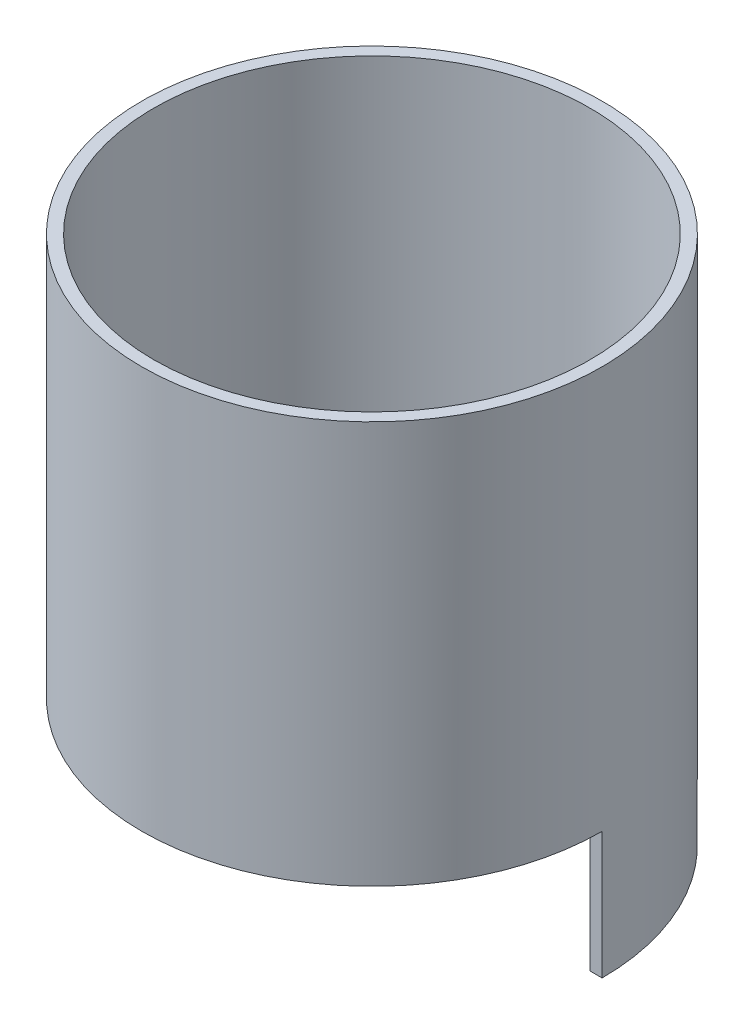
ISO-10303-21;
HEADER;
FILE_DESCRIPTION(('STEP AP214'),'2;1');
FILE_NAME('part.step','',(''),(''),'','','');
FILE_SCHEMA(('AUTOMOTIVE_DESIGN { 1 0 10303 214 1 1 1 1 }'));
ENDSEC;
DATA;
#1=APPLICATION_CONTEXT('core data for automotive mechanical design processes');
#2=APPLICATION_PROTOCOL_DEFINITION('international standard','automotive_design',2000,#1);
#3=PRODUCT_CONTEXT('',#1,'mechanical');
#4=PRODUCT('Part','Part','',(#3));
#5=PRODUCT_RELATED_PRODUCT_CATEGORY('part','',(#4));
#6=PRODUCT_DEFINITION_FORMATION('','',#4);
#7=PRODUCT_DEFINITION_CONTEXT('part definition',#1,'design');
#8=PRODUCT_DEFINITION('design','',#6,#7);
#9=PRODUCT_DEFINITION_SHAPE('','',#8);
#10=(LENGTH_UNIT() NAMED_UNIT(*) SI_UNIT(.MILLI.,.METRE.));
#11=(NAMED_UNIT(*) PLANE_ANGLE_UNIT() SI_UNIT($,.RADIAN.));
#12=(NAMED_UNIT(*) SI_UNIT($,.STERADIAN.) SOLID_ANGLE_UNIT());
#13=UNCERTAINTY_MEASURE_WITH_UNIT(LENGTH_MEASURE(1.E-05),#10,'distance_accuracy_value','');
#14=(GEOMETRIC_REPRESENTATION_CONTEXT(3) GLOBAL_UNCERTAINTY_ASSIGNED_CONTEXT((#13)) GLOBAL_UNIT_ASSIGNED_CONTEXT((#10,
#11,#12)) REPRESENTATION_CONTEXT('',''));
#15=CARTESIAN_POINT('',(0.,0.,0.));
#16=DIRECTION('',(0.,0.,1.));
#17=DIRECTION('',(1.,0.,0.));
#18=AXIS2_PLACEMENT_3D('',#15,#16,#17);
#19=CARTESIAN_POINT('',(0.,0.,0.));
#20=DIRECTION('',(0.,1.,0.));
#21=DIRECTION('',(0.,0.,1.));
#22=AXIS2_PLACEMENT_3D('',#19,#20,#21);
#23=CYLINDRICAL_SURFACE('',#22,36.05);
#24=CARTESIAN_POINT('',(0.,87.5,0.));
#25=DIRECTION('',(0.,1.,0.));
#26=DIRECTION('',(0.,0.,1.));
#27=AXIS2_PLACEMENT_3D('',#24,#25,#26);
#28=CIRCLE('',#27,36.05);
#29=CARTESIAN_POINT('',(0.,87.5,36.05));
#30=VERTEX_POINT('',#29);
#31=EDGE_CURVE('E87',#30,#30,#28,.F.);
#32=ORIENTED_EDGE('',*,*,#31,.F.);
#33=EDGE_LOOP('',(#32));
#34=FACE_BOUND('',#33,.T.);
#35=DIRECTION('',(0.,1.,0.));
#36=VECTOR('',#35,1.);
#37=CARTESIAN_POINT('',(36.05,0.,0.));
#38=LINE('',#37,#36);
#39=CARTESIAN_POINT('',(36.05,0.,0.));
#40=VERTEX_POINT('',#39);
#41=CARTESIAN_POINT('',(36.05,21.,0.));
#42=VERTEX_POINT('',#41);
#43=EDGE_CURVE('E51',#40,#42,#38,.T.);
#44=ORIENTED_EDGE('',*,*,#43,.T.);
#45=CARTESIAN_POINT('',(0.,21.,0.));
#46=DIRECTION('',(0.,1.,0.));
#47=DIRECTION('',(0.,0.,1.));
#48=AXIS2_PLACEMENT_3D('',#45,#46,#47);
#49=CIRCLE('',#48,36.05);
#50=CARTESIAN_POINT('',(-36.05,21.,0.));
#51=VERTEX_POINT('',#50);
#52=EDGE_CURVE('E19',#42,#51,#49,.F.);
#53=ORIENTED_EDGE('',*,*,#52,.T.);
#54=DIRECTION('',(0.,1.,0.));
#55=VECTOR('',#54,1.);
#56=CARTESIAN_POINT('',(-36.05,0.,0.));
#57=LINE('',#56,#55);
#58=CARTESIAN_POINT('',(-36.05,0.,0.));
#59=VERTEX_POINT('',#58);
#60=EDGE_CURVE('E89',#51,#59,#57,.F.);
#61=ORIENTED_EDGE('',*,*,#60,.T.);
#62=CARTESIAN_POINT('',(0.,0.,0.));
#63=DIRECTION('',(0.,1.,0.));
#64=DIRECTION('',(0.,0.,1.));
#65=AXIS2_PLACEMENT_3D('',#62,#63,#64);
#66=CIRCLE('',#65,36.05);
#67=EDGE_CURVE('E64',#59,#40,#66,.F.);
#68=ORIENTED_EDGE('',*,*,#67,.T.);
#69=EDGE_LOOP('',(#44,#53,#61,#68));
#70=FACE_BOUND('',#69,.T.);
#71=ADVANCED_FACE('F16',(#34,#70),#23,.F.);
#72=CARTESIAN_POINT('',(-45.66,21.,0.));
#73=DIRECTION('',(0.,1.,0.));
#74=DIRECTION('',(0.,0.,1.));
#75=AXIS2_PLACEMENT_3D('',#72,#73,#74);
#76=PLANE('',#75);
#77=CARTESIAN_POINT('',(0.,21.,0.));
#78=DIRECTION('',(0.,1.,0.));
#79=DIRECTION('',(0.,0.,1.));
#80=AXIS2_PLACEMENT_3D('',#77,#78,#79);
#81=CIRCLE('',#80,38.05);
#82=CARTESIAN_POINT('',(-38.05,21.,0.));
#83=VERTEX_POINT('',#82);
#84=CARTESIAN_POINT('',(38.05,21.,0.));
#85=VERTEX_POINT('',#84);
#86=EDGE_CURVE('E84',#83,#85,#81,.T.);
#87=ORIENTED_EDGE('',*,*,#86,.F.);
#88=DIRECTION('',(-1.,0.,0.));
#89=VECTOR('',#88,1.);
#90=CARTESIAN_POINT('',(-45.66,21.,0.));
#91=LINE('',#90,#89);
#92=EDGE_CURVE('E68',#83,#51,#91,.F.);
#93=ORIENTED_EDGE('',*,*,#92,.T.);
#94=ORIENTED_EDGE('',*,*,#52,.F.);
#95=DIRECTION('',(-1.,0.,0.));
#96=VECTOR('',#95,1.);
#97=CARTESIAN_POINT('',(-45.66,21.,0.));
#98=LINE('',#97,#96);
#99=EDGE_CURVE('E34',#42,#85,#98,.F.);
#100=ORIENTED_EDGE('',*,*,#99,.T.);
#101=EDGE_LOOP('',(#87,#93,#94,#100));
#102=FACE_BOUND('',#101,.T.);
#103=ADVANCED_FACE('F90',(#102),#76,.F.);
#104=CARTESIAN_POINT('',(0.,0.,0.));
#105=DIRECTION('',(0.,1.,0.));
#106=DIRECTION('',(0.,0.,1.));
#107=AXIS2_PLACEMENT_3D('',#104,#105,#106);
#108=PLANE('',#107);
#109=DIRECTION('',(-1.,0.,0.));
#110=VECTOR('',#109,1.);
#111=CARTESIAN_POINT('',(-45.66,0.,0.));
#112=LINE('',#111,#110);
#113=CARTESIAN_POINT('',(38.05,0.,0.));
#114=VERTEX_POINT('',#113);
#115=EDGE_CURVE('E86',#114,#40,#112,.T.);
#116=ORIENTED_EDGE('',*,*,#115,.T.);
#117=ORIENTED_EDGE('',*,*,#67,.F.);
#118=DIRECTION('',(-1.,0.,0.));
#119=VECTOR('',#118,1.);
#120=CARTESIAN_POINT('',(-45.66,0.,0.));
#121=LINE('',#120,#119);
#122=CARTESIAN_POINT('',(-38.05,0.,0.));
#123=VERTEX_POINT('',#122);
#124=EDGE_CURVE('E61',#59,#123,#121,.T.);
#125=ORIENTED_EDGE('',*,*,#124,.T.);
#126=CARTESIAN_POINT('',(0.,0.,0.));
#127=DIRECTION('',(0.,1.,0.));
#128=DIRECTION('',(0.,0.,1.));
#129=AXIS2_PLACEMENT_3D('',#126,#127,#128);
#130=CIRCLE('',#129,38.05);
#131=EDGE_CURVE('E58',#114,#123,#130,.T.);
#132=ORIENTED_EDGE('',*,*,#131,.F.);
#133=EDGE_LOOP('',(#116,#117,#125,#132));
#134=FACE_BOUND('',#133,.T.);
#135=ADVANCED_FACE('F63',(#134),#108,.F.);
#136=CARTESIAN_POINT('',(-45.66,0.,0.));
#137=DIRECTION('',(0.,0.,-1.));
#138=DIRECTION('',(-1.,0.,0.));
#139=AXIS2_PLACEMENT_3D('',#136,#137,#138);
#140=PLANE('',#139);
#141=ORIENTED_EDGE('',*,*,#92,.F.);
#142=DIRECTION('',(0.,1.,0.));
#143=VECTOR('',#142,1.);
#144=CARTESIAN_POINT('',(-38.05,0.,0.));
#145=LINE('',#144,#143);
#146=EDGE_CURVE('E72',#123,#83,#145,.T.);
#147=ORIENTED_EDGE('',*,*,#146,.F.);
#148=ORIENTED_EDGE('',*,*,#124,.F.);
#149=ORIENTED_EDGE('',*,*,#60,.F.);
#150=EDGE_LOOP('',(#141,#147,#148,#149));
#151=FACE_BOUND('',#150,.T.);
#152=ADVANCED_FACE('F73',(#151),#140,.F.);
#153=CARTESIAN_POINT('',(0.,87.5,0.));
#154=DIRECTION('',(0.,1.,0.));
#155=DIRECTION('',(0.,0.,1.));
#156=AXIS2_PLACEMENT_3D('',#153,#154,#155);
#157=PLANE('',#156);
#158=ORIENTED_EDGE('',*,*,#31,.T.);
#159=EDGE_LOOP('',(#158));
#160=FACE_BOUND('',#159,.T.);
#161=CARTESIAN_POINT('',(0.,87.5,0.));
#162=DIRECTION('',(0.,1.,0.));
#163=DIRECTION('',(0.,0.,1.));
#164=AXIS2_PLACEMENT_3D('',#161,#162,#163);
#165=CIRCLE('',#164,38.05);
#166=CARTESIAN_POINT('',(0.,87.5,38.05));
#167=VERTEX_POINT('',#166);
#168=EDGE_CURVE('E25',#167,#167,#165,.F.);
#169=ORIENTED_EDGE('',*,*,#168,.F.);
#170=EDGE_LOOP('',(#169));
#171=FACE_BOUND('',#170,.T.);
#172=ADVANCED_FACE('F97',(#160,#171),#157,.T.);
#173=CARTESIAN_POINT('',(-45.66,0.,0.));
#174=DIRECTION('',(0.,0.,-1.));
#175=DIRECTION('',(-1.,0.,0.));
#176=AXIS2_PLACEMENT_3D('',#173,#174,#175);
#177=PLANE('',#176);
#178=ORIENTED_EDGE('',*,*,#99,.F.);
#179=ORIENTED_EDGE('',*,*,#43,.F.);
#180=ORIENTED_EDGE('',*,*,#115,.F.);
#181=DIRECTION('',(0.,1.,0.));
#182=VECTOR('',#181,1.);
#183=CARTESIAN_POINT('',(38.05,0.,0.));
#184=LINE('',#183,#182);
#185=EDGE_CURVE('E11',#85,#114,#184,.F.);
#186=ORIENTED_EDGE('',*,*,#185,.F.);
#187=EDGE_LOOP('',(#178,#179,#180,#186));
#188=FACE_BOUND('',#187,.T.);
#189=ADVANCED_FACE('F95',(#188),#177,.F.);
#190=CARTESIAN_POINT('',(0.,0.,0.));
#191=DIRECTION('',(0.,1.,0.));
#192=DIRECTION('',(0.,0.,1.));
#193=AXIS2_PLACEMENT_3D('',#190,#191,#192);
#194=CYLINDRICAL_SURFACE('',#193,38.05);
#195=ORIENTED_EDGE('',*,*,#168,.T.);
#196=EDGE_LOOP('',(#195));
#197=FACE_BOUND('',#196,.T.);
#198=ORIENTED_EDGE('',*,*,#146,.T.);
#199=ORIENTED_EDGE('',*,*,#86,.T.);
#200=ORIENTED_EDGE('',*,*,#185,.T.);
#201=ORIENTED_EDGE('',*,*,#131,.T.);
#202=EDGE_LOOP('',(#198,#199,#200,#201));
#203=FACE_BOUND('',#202,.T.);
#204=ADVANCED_FACE('F77',(#197,#203),#194,.T.);
#205=CLOSED_SHELL('',(#71,#103,#135,#152,#172,#189,#204));
#206=MANIFOLD_SOLID_BREP('B1',#205);
#207=ADVANCED_BREP_SHAPE_REPRESENTATION('',(#18,#206),#14);
#208=SHAPE_DEFINITION_REPRESENTATION(#9,#207);
ENDSEC;
END-ISO-10303-21;
